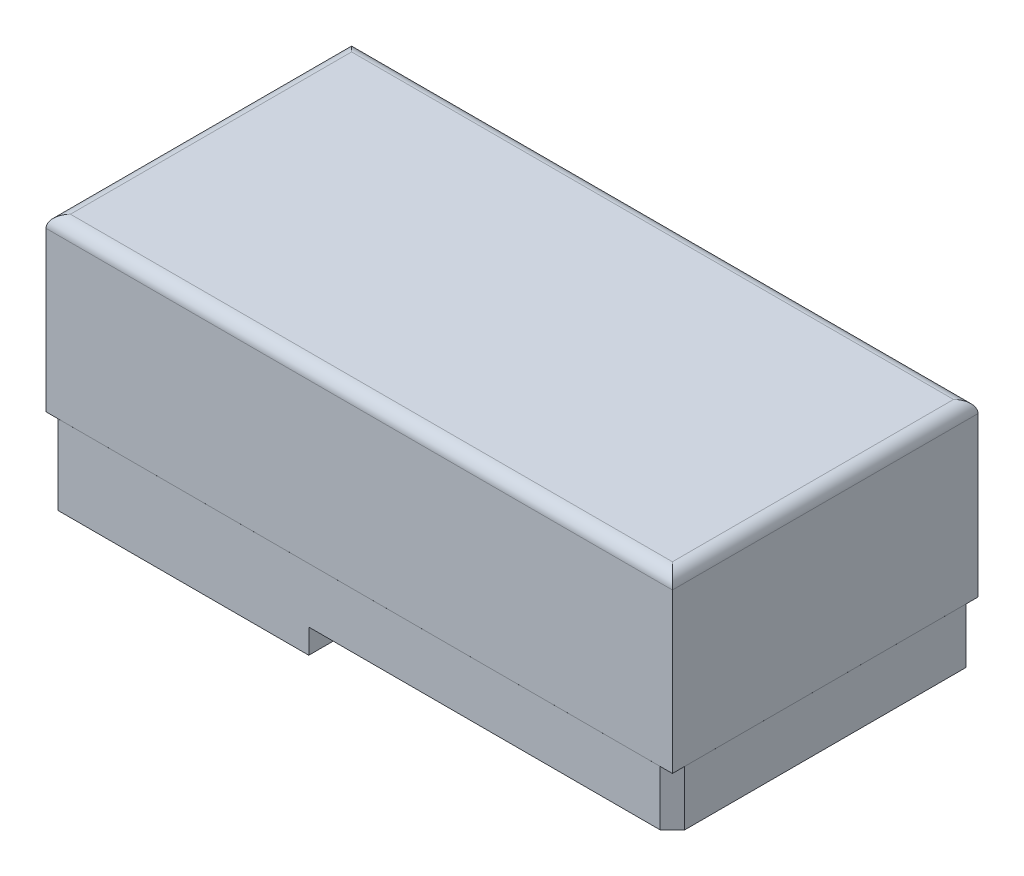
from build123d import *

# Parameters (mm, degrees)
EXTRUDE_1_DEPTH     = 25
SKETCH_2_R          = 8
CUT_EXTRUDE_1_DEPTH = 94.251838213
SKETCH_5_R          = 8
CUT_EXTRUDE_2_DEPTH = 94.251838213
SKETCH_6_W          = 102.5
SKETCH_6_H          = 50
EXTRUDE_2_DEPTH     = 29
SKETCH_7_W          = 111.684193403
SKETCH_7_H          = 53.689967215
CUT_EXTRUDE_3_DEPTH = 0.001
FILLET_1_R          = 2
CHAMFER_1_SIZE      = 2


with BuildPart() as part:
    # Sketch 1 → Extrude 1 (new, symmetric)
    with BuildSketch(Plane.XY):
        Polygon((-89.033169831, -4), (-89.033169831, 8), (13.466830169, 8), (13.466830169, 0), (-46.033169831, 0), (-46.033169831, -4), align=None)
    extrude(amount=EXTRUDE_1_DEPTH, both=True)

    # Sketch 2 → Cut-Extrude 1 (cut, through all)
    with BuildSketch(Plane(origin=(0, 8, 0), x_dir=(1, 0, 0), z_dir=(0, 1, 0))):
        with Locations(Location((-68.033169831, 0, 0), (0, 0, 270))):
            Circle(SKETCH_2_R)
    extrude(amount=-CUT_EXTRUDE_1_DEPTH, mode=Mode.SUBTRACT)

    # Sketch 5 → Cut-Extrude 2 (cut, through all)
    with BuildSketch(Plane(origin=(0, 8, 0), x_dir=(1, 0, 0), z_dir=(0, 1, 0))):
        with Locations(Location((-68.033169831, 0, 0), (0, 0, 270))):
            Circle(SKETCH_5_R)
        with BuildLine():
            Line((-14.533169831, 5), (-4.533169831, 5))
            ThreePointArc((-4.533169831, 5), (0.466830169, 0), (-4.533169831, -5))
            Line((-4.533169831, -5), (-14.533169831, -5))
            ThreePointArc((-14.533169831, -5), (-19.533169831, 0), (-14.533169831, 5))
        make_face()
    extrude(amount=-CUT_EXTRUDE_2_DEPTH, mode=Mode.SUBTRACT)

    # Sketch 6 → Extrude 2 (add)
    with BuildSketch(Plane(origin=(0, 8, 0), x_dir=(1, 0, 0), z_dir=(0, 1, 0))):
        with Locations((-37.783169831, 0)):
            Rectangle(SKETCH_6_W, SKETCH_6_H)
    extrude(amount=EXTRUDE_2_DEPTH)

    # Sketch 7 → Cut-Extrude 3 (cut)
    with BuildSketch(Plane(origin=(0, 9, 0), x_dir=(-1, 0, 0), z_dir=(0, -1, 0))):
        with Locations((40.146848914, -0.736254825)):
            Rectangle(SKETCH_7_W, SKETCH_7_H)
    extrude(amount=-CUT_EXTRUDE_3_DEPTH, mode=Mode.SUBTRACT)


with BuildPart() as cut_extrude_3_piece_1:
    # of the separate pieces the step leaves, piece 1, a body of its own (cut_extrude_3_pieces)
    add(part.part.solids().sort_by_distance((-89.033169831, 9.001, -25))[0])

    # Fillet 1
    fillet_1_edges = [cut_extrude_3_piece_1.edges().sort_by_distance(p)[0] for p in [
        (-89.033169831, 37, 0),
        (-37.783169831, 37, 25),
        (13.466830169, 37, 0),
        (-37.783169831, 37, -25),
    ]]
    fillet(fillet_1_edges, radius=FILLET_1_R)


with BuildPart() as cut_extrude_3_piece_2:
    # of the separate pieces the step leaves, piece 2, a body of its own (cut_extrude_3_pieces)
    add(part.part.solids().sort_by_distance((-89.033169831, -4, -25))[0])

    # Chamfer 1
    chamfer_1_edges = [cut_extrude_3_piece_2.edges().sort_by_distance(p)[0] for p in [
        (13.466830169, 4.5, -25),
        (-89.033169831, 2.5, -25),
        (13.466830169, 4.5, 25),
        (-89.033169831, 2.5, 25),
    ]]
    chamfer(chamfer_1_edges, length=CHAMFER_1_SIZE)


solid = Compound([cut_extrude_3_piece_1.part, cut_extrude_3_piece_2.part])
